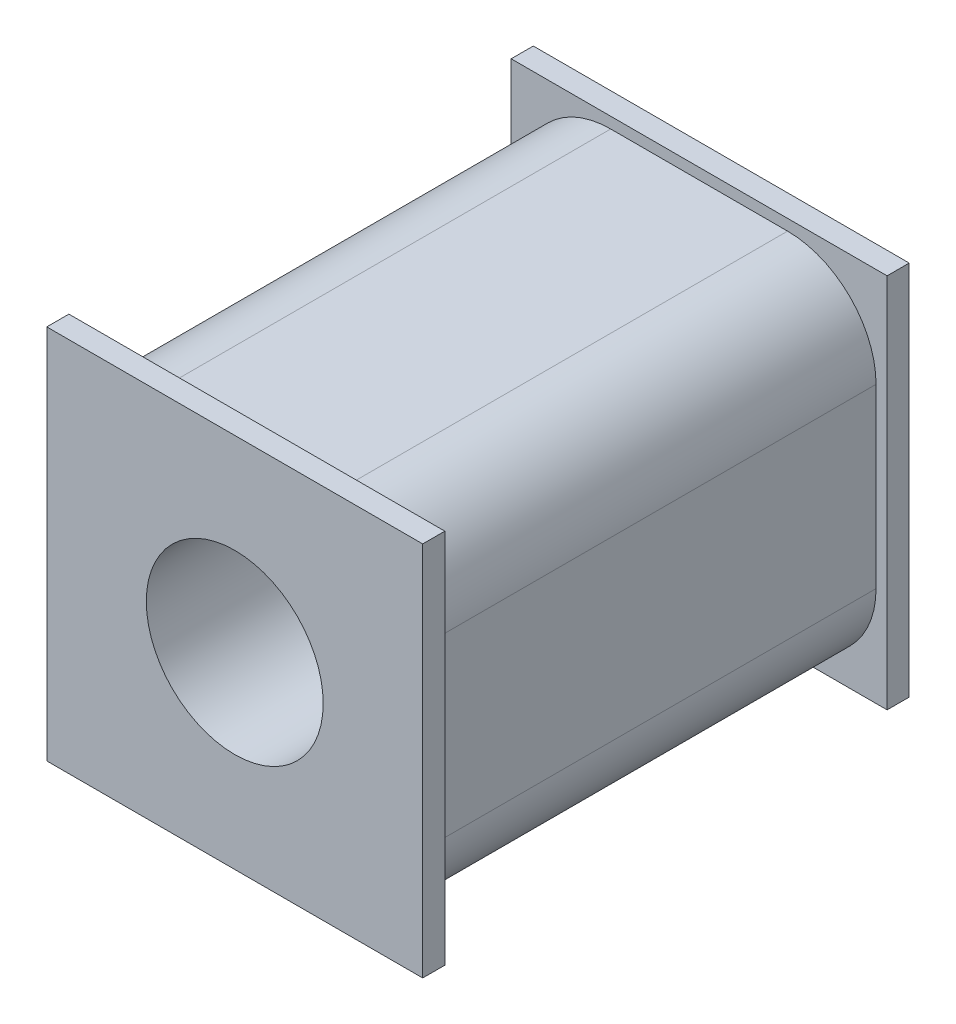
ISO-10303-21;
HEADER;
FILE_DESCRIPTION(('STEP AP214'),'2;1');
FILE_NAME('part.step','',(''),(''),'','','');
FILE_SCHEMA(('AUTOMOTIVE_DESIGN { 1 0 10303 214 1 1 1 1 }'));
ENDSEC;
DATA;
#1=APPLICATION_CONTEXT('core data for automotive mechanical design processes');
#2=APPLICATION_PROTOCOL_DEFINITION('international standard','automotive_design',2000,#1);
#3=PRODUCT_CONTEXT('',#1,'mechanical');
#4=PRODUCT('Part','Part','',(#3));
#5=PRODUCT_RELATED_PRODUCT_CATEGORY('part','',(#4));
#6=PRODUCT_DEFINITION_FORMATION('','',#4);
#7=PRODUCT_DEFINITION_CONTEXT('part definition',#1,'design');
#8=PRODUCT_DEFINITION('design','',#6,#7);
#9=PRODUCT_DEFINITION_SHAPE('','',#8);
#10=(LENGTH_UNIT() NAMED_UNIT(*) SI_UNIT(.MILLI.,.METRE.));
#11=(NAMED_UNIT(*) PLANE_ANGLE_UNIT() SI_UNIT($,.RADIAN.));
#12=(NAMED_UNIT(*) SI_UNIT($,.STERADIAN.) SOLID_ANGLE_UNIT());
#13=UNCERTAINTY_MEASURE_WITH_UNIT(LENGTH_MEASURE(1.E-05),#10,'distance_accuracy_value','');
#14=(GEOMETRIC_REPRESENTATION_CONTEXT(3) GLOBAL_UNCERTAINTY_ASSIGNED_CONTEXT((#13)) GLOBAL_UNIT_ASSIGNED_CONTEXT((#10,
#11,#12)) REPRESENTATION_CONTEXT('',''));
#15=CARTESIAN_POINT('',(0.,0.,0.));
#16=DIRECTION('',(0.,0.,1.));
#17=DIRECTION('',(1.,0.,0.));
#18=AXIS2_PLACEMENT_3D('',#15,#16,#17);
#19=CARTESIAN_POINT('',(-4.,4.,10.));
#20=DIRECTION('',(1.,0.,0.));
#21=DIRECTION('',(0.,1.,0.));
#22=AXIS2_PLACEMENT_3D('',#19,#20,#21);
#23=PLANE('',#22);
#24=DIRECTION('',(0.,-1.,0.));
#25=VECTOR('',#24,1.);
#26=CARTESIAN_POINT('',(-4.,4.,10.));
#27=LINE('',#26,#25);
#28=CARTESIAN_POINT('',(-4.,2.,10.));
#29=VERTEX_POINT('',#28);
#30=CARTESIAN_POINT('',(-4.,-2.,10.));
#31=VERTEX_POINT('',#30);
#32=EDGE_CURVE('E223',#29,#31,#27,.T.);
#33=ORIENTED_EDGE('',*,*,#32,.F.);
#34=DIRECTION('',(0.,0.,-1.));
#35=VECTOR('',#34,1.);
#36=CARTESIAN_POINT('',(-4.,2.,10.));
#37=LINE('',#36,#35);
#38=CARTESIAN_POINT('',(-4.,2.,0.));
#39=VERTEX_POINT('',#38);
#40=EDGE_CURVE('E11',#29,#39,#37,.T.);
#41=ORIENTED_EDGE('',*,*,#40,.T.);
#42=DIRECTION('',(0.,-1.,0.));
#43=VECTOR('',#42,1.);
#44=CARTESIAN_POINT('',(-4.,4.,0.));
#45=LINE('',#44,#43);
#46=CARTESIAN_POINT('',(-4.,-2.,0.));
#47=VERTEX_POINT('',#46);
#48=EDGE_CURVE('E215',#39,#47,#45,.T.);
#49=ORIENTED_EDGE('',*,*,#48,.T.);
#50=DIRECTION('',(0.,0.,-1.));
#51=VECTOR('',#50,1.);
#52=CARTESIAN_POINT('',(-4.,-2.,10.));
#53=LINE('',#52,#51);
#54=EDGE_CURVE('E36',#47,#31,#53,.F.);
#55=ORIENTED_EDGE('',*,*,#54,.T.);
#56=EDGE_LOOP('',(#33,#41,#49,#55));
#57=FACE_BOUND('',#56,.T.);
#58=ADVANCED_FACE('F29',(#57),#23,.F.);
#59=CARTESIAN_POINT('',(-4.,-4.,10.));
#60=DIRECTION('',(0.,1.,0.));
#61=DIRECTION('',(-1.,0.,0.));
#62=AXIS2_PLACEMENT_3D('',#59,#60,#61);
#63=PLANE('',#62);
#64=DIRECTION('',(1.,0.,0.));
#65=VECTOR('',#64,1.);
#66=CARTESIAN_POINT('',(-4.,-4.,0.));
#67=LINE('',#66,#65);
#68=CARTESIAN_POINT('',(-2.,-4.,0.));
#69=VERTEX_POINT('',#68);
#70=CARTESIAN_POINT('',(2.,-4.,0.));
#71=VERTEX_POINT('',#70);
#72=EDGE_CURVE('E217',#69,#71,#67,.T.);
#73=ORIENTED_EDGE('',*,*,#72,.T.);
#74=DIRECTION('',(0.,0.,-1.));
#75=VECTOR('',#74,1.);
#76=CARTESIAN_POINT('',(2.,-4.,10.));
#77=LINE('',#76,#75);
#78=CARTESIAN_POINT('',(2.,-4.,10.));
#79=VERTEX_POINT('',#78);
#80=EDGE_CURVE('E43',#71,#79,#77,.F.);
#81=ORIENTED_EDGE('',*,*,#80,.T.);
#82=DIRECTION('',(1.,0.,0.));
#83=VECTOR('',#82,1.);
#84=CARTESIAN_POINT('',(-4.,-4.,10.));
#85=LINE('',#84,#83);
#86=CARTESIAN_POINT('',(-2.,-4.,10.));
#87=VERTEX_POINT('',#86);
#88=EDGE_CURVE('E226',#87,#79,#85,.T.);
#89=ORIENTED_EDGE('',*,*,#88,.F.);
#90=DIRECTION('',(0.,0.,-1.));
#91=VECTOR('',#90,1.);
#92=CARTESIAN_POINT('',(-2.,-4.,10.));
#93=LINE('',#92,#91);
#94=EDGE_CURVE('E269',#87,#69,#93,.T.);
#95=ORIENTED_EDGE('',*,*,#94,.T.);
#96=EDGE_LOOP('',(#73,#81,#89,#95));
#97=FACE_BOUND('',#96,.T.);
#98=ADVANCED_FACE('F273',(#97),#63,.F.);
#99=CARTESIAN_POINT('',(4.,4.,10.));
#100=DIRECTION('',(-1.,0.,0.));
#101=DIRECTION('',(0.,0.,1.));
#102=AXIS2_PLACEMENT_3D('',#99,#100,#101);
#103=PLANE('',#102);
#104=DIRECTION('',(0.,1.,0.));
#105=VECTOR('',#104,1.);
#106=CARTESIAN_POINT('',(4.,4.,0.));
#107=LINE('',#106,#105);
#108=CARTESIAN_POINT('',(4.,-2.,0.));
#109=VERTEX_POINT('',#108);
#110=CARTESIAN_POINT('',(4.,2.,0.));
#111=VERTEX_POINT('',#110);
#112=EDGE_CURVE('E219',#109,#111,#107,.T.);
#113=ORIENTED_EDGE('',*,*,#112,.T.);
#114=DIRECTION('',(0.,0.,-1.));
#115=VECTOR('',#114,1.);
#116=CARTESIAN_POINT('',(4.,2.,10.));
#117=LINE('',#116,#115);
#118=CARTESIAN_POINT('',(4.,2.,10.));
#119=VERTEX_POINT('',#118);
#120=EDGE_CURVE('E255',#111,#119,#117,.F.);
#121=ORIENTED_EDGE('',*,*,#120,.T.);
#122=DIRECTION('',(0.,1.,0.));
#123=VECTOR('',#122,1.);
#124=CARTESIAN_POINT('',(4.,4.,10.));
#125=LINE('',#124,#123);
#126=CARTESIAN_POINT('',(4.,-2.,10.));
#127=VERTEX_POINT('',#126);
#128=EDGE_CURVE('E229',#127,#119,#125,.T.);
#129=ORIENTED_EDGE('',*,*,#128,.F.);
#130=DIRECTION('',(0.,0.,-1.));
#131=VECTOR('',#130,1.);
#132=CARTESIAN_POINT('',(4.,-2.,10.));
#133=LINE('',#132,#131);
#134=EDGE_CURVE('E252',#127,#109,#133,.T.);
#135=ORIENTED_EDGE('',*,*,#134,.T.);
#136=EDGE_LOOP('',(#113,#121,#129,#135));
#137=FACE_BOUND('',#136,.T.);
#138=ADVANCED_FACE('F282',(#137),#103,.F.);
#139=CARTESIAN_POINT('',(-4.,4.,10.));
#140=DIRECTION('',(0.,-1.,0.));
#141=DIRECTION('',(0.,0.,-1.));
#142=AXIS2_PLACEMENT_3D('',#139,#140,#141);
#143=PLANE('',#142);
#144=DIRECTION('',(-1.,0.,0.));
#145=VECTOR('',#144,1.);
#146=CARTESIAN_POINT('',(-4.,4.,10.));
#147=LINE('',#146,#145);
#148=CARTESIAN_POINT('',(2.,4.,10.));
#149=VERTEX_POINT('',#148);
#150=CARTESIAN_POINT('',(-2.,4.,10.));
#151=VERTEX_POINT('',#150);
#152=EDGE_CURVE('E232',#149,#151,#147,.T.);
#153=ORIENTED_EDGE('',*,*,#152,.F.);
#154=DIRECTION('',(0.,0.,-1.));
#155=VECTOR('',#154,1.);
#156=CARTESIAN_POINT('',(2.,4.,10.));
#157=LINE('',#156,#155);
#158=CARTESIAN_POINT('',(2.,4.,0.));
#159=VERTEX_POINT('',#158);
#160=EDGE_CURVE('E237',#149,#159,#157,.T.);
#161=ORIENTED_EDGE('',*,*,#160,.T.);
#162=DIRECTION('',(-1.,0.,0.));
#163=VECTOR('',#162,1.);
#164=CARTESIAN_POINT('',(-4.,4.,0.));
#165=LINE('',#164,#163);
#166=CARTESIAN_POINT('',(-2.,4.,0.));
#167=VERTEX_POINT('',#166);
#168=EDGE_CURVE('E221',#159,#167,#165,.T.);
#169=ORIENTED_EDGE('',*,*,#168,.T.);
#170=DIRECTION('',(0.,0.,-1.));
#171=VECTOR('',#170,1.);
#172=CARTESIAN_POINT('',(-2.,4.,10.));
#173=LINE('',#172,#171);
#174=EDGE_CURVE('E235',#167,#151,#173,.F.);
#175=ORIENTED_EDGE('',*,*,#174,.T.);
#176=EDGE_LOOP('',(#153,#161,#169,#175));
#177=FACE_BOUND('',#176,.T.);
#178=ADVANCED_FACE('F296',(#177),#143,.F.);
#179=CARTESIAN_POINT('',(2.,2.,10.));
#180=DIRECTION('',(0.,0.,-1.));
#181=DIRECTION('',(-1.,0.,0.));
#182=AXIS2_PLACEMENT_3D('',#179,#180,#181);
#183=CYLINDRICAL_SURFACE('',#182,2.);
#184=CARTESIAN_POINT('',(2.,2.,10.));
#185=DIRECTION('',(0.,0.,1.));
#186=DIRECTION('',(1.,0.,0.));
#187=AXIS2_PLACEMENT_3D('',#184,#185,#186);
#188=CIRCLE('',#187,2.);
#189=EDGE_CURVE('E266',#119,#149,#188,.T.);
#190=ORIENTED_EDGE('',*,*,#189,.F.);
#191=ORIENTED_EDGE('',*,*,#120,.F.);
#192=CARTESIAN_POINT('',(2.,2.,0.));
#193=DIRECTION('',(0.,0.,1.));
#194=DIRECTION('',(1.,0.,0.));
#195=AXIS2_PLACEMENT_3D('',#192,#193,#194);
#196=CIRCLE('',#195,2.);
#197=EDGE_CURVE('E249',#159,#111,#196,.F.);
#198=ORIENTED_EDGE('',*,*,#197,.F.);
#199=ORIENTED_EDGE('',*,*,#160,.F.);
#200=EDGE_LOOP('',(#190,#191,#198,#199));
#201=FACE_BOUND('',#200,.T.);
#202=ADVANCED_FACE('F299',(#201),#183,.T.);
#203=CARTESIAN_POINT('',(2.,-2.,10.));
#204=DIRECTION('',(0.,0.,-1.));
#205=DIRECTION('',(-1.,0.,0.));
#206=AXIS2_PLACEMENT_3D('',#203,#204,#205);
#207=CYLINDRICAL_SURFACE('',#206,2.);
#208=CARTESIAN_POINT('',(2.,-2.,10.));
#209=DIRECTION('',(0.,0.,1.));
#210=DIRECTION('',(1.,0.,0.));
#211=AXIS2_PLACEMENT_3D('',#208,#209,#210);
#212=CIRCLE('',#211,2.);
#213=EDGE_CURVE('E263',#79,#127,#212,.T.);
#214=ORIENTED_EDGE('',*,*,#213,.F.);
#215=ORIENTED_EDGE('',*,*,#80,.F.);
#216=CARTESIAN_POINT('',(2.,-2.,0.));
#217=DIRECTION('',(0.,0.,1.));
#218=DIRECTION('',(1.,0.,0.));
#219=AXIS2_PLACEMENT_3D('',#216,#217,#218);
#220=CIRCLE('',#219,2.);
#221=EDGE_CURVE('E246',#109,#71,#220,.F.);
#222=ORIENTED_EDGE('',*,*,#221,.F.);
#223=ORIENTED_EDGE('',*,*,#134,.F.);
#224=EDGE_LOOP('',(#214,#215,#222,#223));
#225=FACE_BOUND('',#224,.T.);
#226=ADVANCED_FACE('F280',(#225),#207,.T.);
#227=CARTESIAN_POINT('',(-2.,2.,10.));
#228=DIRECTION('',(0.,0.,-1.));
#229=DIRECTION('',(-1.,0.,0.));
#230=AXIS2_PLACEMENT_3D('',#227,#228,#229);
#231=CYLINDRICAL_SURFACE('',#230,2.);
#232=CARTESIAN_POINT('',(-2.,2.,10.));
#233=DIRECTION('',(0.,0.,1.));
#234=DIRECTION('',(1.,0.,0.));
#235=AXIS2_PLACEMENT_3D('',#232,#233,#234);
#236=CIRCLE('',#235,2.);
#237=EDGE_CURVE('E260',#151,#29,#236,.T.);
#238=ORIENTED_EDGE('',*,*,#237,.F.);
#239=ORIENTED_EDGE('',*,*,#174,.F.);
#240=CARTESIAN_POINT('',(-2.,2.,0.));
#241=DIRECTION('',(0.,0.,1.));
#242=DIRECTION('',(1.,0.,0.));
#243=AXIS2_PLACEMENT_3D('',#240,#241,#242);
#244=CIRCLE('',#243,2.);
#245=EDGE_CURVE('E243',#39,#167,#244,.F.);
#246=ORIENTED_EDGE('',*,*,#245,.F.);
#247=ORIENTED_EDGE('',*,*,#40,.F.);
#248=EDGE_LOOP('',(#238,#239,#246,#247));
#249=FACE_BOUND('',#248,.T.);
#250=ADVANCED_FACE('F294',(#249),#231,.T.);
#251=CARTESIAN_POINT('',(-2.,-2.,10.));
#252=DIRECTION('',(0.,0.,-1.));
#253=DIRECTION('',(-1.,0.,0.));
#254=AXIS2_PLACEMENT_3D('',#251,#252,#253);
#255=CYLINDRICAL_SURFACE('',#254,2.);
#256=CARTESIAN_POINT('',(-2.,-2.,10.));
#257=DIRECTION('',(0.,0.,1.));
#258=DIRECTION('',(1.,0.,0.));
#259=AXIS2_PLACEMENT_3D('',#256,#257,#258);
#260=CIRCLE('',#259,2.);
#261=EDGE_CURVE('E257',#31,#87,#260,.T.);
#262=ORIENTED_EDGE('',*,*,#261,.F.);
#263=ORIENTED_EDGE('',*,*,#54,.F.);
#264=CARTESIAN_POINT('',(-2.,-2.,0.));
#265=DIRECTION('',(0.,0.,1.));
#266=DIRECTION('',(1.,0.,0.));
#267=AXIS2_PLACEMENT_3D('',#264,#265,#266);
#268=CIRCLE('',#267,2.);
#269=EDGE_CURVE('E240',#69,#47,#268,.F.);
#270=ORIENTED_EDGE('',*,*,#269,.F.);
#271=ORIENTED_EDGE('',*,*,#94,.F.);
#272=EDGE_LOOP('',(#262,#263,#270,#271));
#273=FACE_BOUND('',#272,.T.);
#274=ADVANCED_FACE('F288',(#273),#255,.T.);
#275=CARTESIAN_POINT('',(-4.25,-4.25,10.));
#276=DIRECTION('',(0.,0.,1.));
#277=DIRECTION('',(1.,0.,0.));
#278=AXIS2_PLACEMENT_3D('',#275,#276,#277);
#279=PLANE('',#278);
#280=ORIENTED_EDGE('',*,*,#189,.T.);
#281=ORIENTED_EDGE('',*,*,#152,.T.);
#282=ORIENTED_EDGE('',*,*,#237,.T.);
#283=ORIENTED_EDGE('',*,*,#32,.T.);
#284=ORIENTED_EDGE('',*,*,#261,.T.);
#285=ORIENTED_EDGE('',*,*,#88,.T.);
#286=ORIENTED_EDGE('',*,*,#213,.T.);
#287=ORIENTED_EDGE('',*,*,#128,.T.);
#288=EDGE_LOOP('',(#280,#281,#282,#283,#284,#285,#286,#287));
#289=FACE_BOUND('',#288,.T.);
#290=DIRECTION('',(0.,-1.,0.));
#291=VECTOR('',#290,1.);
#292=CARTESIAN_POINT('',(-4.25,4.25,10.));
#293=LINE('',#292,#291);
#294=CARTESIAN_POINT('',(-4.25,4.25,10.));
#295=VERTEX_POINT('',#294);
#296=CARTESIAN_POINT('',(-4.25,-4.25,10.));
#297=VERTEX_POINT('',#296);
#298=EDGE_CURVE('E152',#295,#297,#293,.T.);
#299=ORIENTED_EDGE('',*,*,#298,.F.);
#300=DIRECTION('',(-1.,0.,0.));
#301=VECTOR('',#300,1.);
#302=CARTESIAN_POINT('',(-4.25,4.25,10.));
#303=LINE('',#302,#301);
#304=CARTESIAN_POINT('',(4.25,4.25,10.));
#305=VERTEX_POINT('',#304);
#306=EDGE_CURVE('E192',#305,#295,#303,.T.);
#307=ORIENTED_EDGE('',*,*,#306,.F.);
#308=DIRECTION('',(0.,1.,0.));
#309=VECTOR('',#308,1.);
#310=CARTESIAN_POINT('',(4.25,4.25,10.));
#311=LINE('',#310,#309);
#312=CARTESIAN_POINT('',(4.25,-4.25,10.));
#313=VERTEX_POINT('',#312);
#314=EDGE_CURVE('E190',#313,#305,#311,.T.);
#315=ORIENTED_EDGE('',*,*,#314,.F.);
#316=DIRECTION('',(1.,0.,0.));
#317=VECTOR('',#316,1.);
#318=CARTESIAN_POINT('',(-4.25,-4.25,10.));
#319=LINE('',#318,#317);
#320=EDGE_CURVE('E188',#297,#313,#319,.T.);
#321=ORIENTED_EDGE('',*,*,#320,.F.);
#322=EDGE_LOOP('',(#299,#307,#315,#321));
#323=FACE_BOUND('',#322,.T.);
#324=ADVANCED_FACE('F286',(#289,#323),#279,.F.);
#325=CARTESIAN_POINT('',(-4.25,-4.25,10.5));
#326=DIRECTION('',(0.,0.,1.));
#327=DIRECTION('',(1.,0.,0.));
#328=AXIS2_PLACEMENT_3D('',#325,#326,#327);
#329=PLANE('',#328);
#330=CARTESIAN_POINT('',(0.,0.,10.5));
#331=DIRECTION('',(0.,0.,-1.));
#332=DIRECTION('',(-1.,0.,0.));
#333=AXIS2_PLACEMENT_3D('',#330,#331,#332);
#334=CIRCLE('',#333,2.);
#335=CARTESIAN_POINT('',(-2.,0.,10.5));
#336=VERTEX_POINT('',#335);
#337=EDGE_CURVE('E162',#336,#336,#334,.T.);
#338=ORIENTED_EDGE('',*,*,#337,.T.);
#339=EDGE_LOOP('',(#338));
#340=FACE_BOUND('',#339,.T.);
#341=DIRECTION('',(0.,-1.,0.));
#342=VECTOR('',#341,1.);
#343=CARTESIAN_POINT('',(-4.25,4.25,10.5));
#344=LINE('',#343,#342);
#345=CARTESIAN_POINT('',(-4.25,4.25,10.5));
#346=VERTEX_POINT('',#345);
#347=CARTESIAN_POINT('',(-4.25,-4.25,10.5));
#348=VERTEX_POINT('',#347);
#349=EDGE_CURVE('E194',#346,#348,#344,.T.);
#350=ORIENTED_EDGE('',*,*,#349,.T.);
#351=DIRECTION('',(1.,0.,0.));
#352=VECTOR('',#351,1.);
#353=CARTESIAN_POINT('',(-4.25,-4.25,10.5));
#354=LINE('',#353,#352);
#355=CARTESIAN_POINT('',(4.25,-4.25,10.5));
#356=VERTEX_POINT('',#355);
#357=EDGE_CURVE('E197',#348,#356,#354,.T.);
#358=ORIENTED_EDGE('',*,*,#357,.T.);
#359=DIRECTION('',(0.,1.,0.));
#360=VECTOR('',#359,1.);
#361=CARTESIAN_POINT('',(4.25,4.25,10.5));
#362=LINE('',#361,#360);
#363=CARTESIAN_POINT('',(4.25,4.25,10.5));
#364=VERTEX_POINT('',#363);
#365=EDGE_CURVE('E199',#356,#364,#362,.T.);
#366=ORIENTED_EDGE('',*,*,#365,.T.);
#367=DIRECTION('',(-1.,0.,0.));
#368=VECTOR('',#367,1.);
#369=CARTESIAN_POINT('',(-4.25,4.25,10.5));
#370=LINE('',#369,#368);
#371=EDGE_CURVE('E201',#364,#346,#370,.T.);
#372=ORIENTED_EDGE('',*,*,#371,.T.);
#373=EDGE_LOOP('',(#350,#358,#366,#372));
#374=FACE_BOUND('',#373,.T.);
#375=ADVANCED_FACE('F333',(#340,#374),#329,.T.);
#376=CARTESIAN_POINT('',(-4.25,4.25,10.5));
#377=DIRECTION('',(0.,-1.,0.));
#378=DIRECTION('',(0.,0.,-1.));
#379=AXIS2_PLACEMENT_3D('',#376,#377,#378);
#380=PLANE('',#379);
#381=ORIENTED_EDGE('',*,*,#306,.T.);
#382=DIRECTION('',(0.,0.,-1.));
#383=VECTOR('',#382,1.);
#384=CARTESIAN_POINT('',(-4.25,4.25,10.5));
#385=LINE('',#384,#383);
#386=EDGE_CURVE('E203',#346,#295,#385,.T.);
#387=ORIENTED_EDGE('',*,*,#386,.F.);
#388=ORIENTED_EDGE('',*,*,#371,.F.);
#389=DIRECTION('',(0.,0.,-1.));
#390=VECTOR('',#389,1.);
#391=CARTESIAN_POINT('',(4.25,4.25,10.5));
#392=LINE('',#391,#390);
#393=EDGE_CURVE('E206',#364,#305,#392,.T.);
#394=ORIENTED_EDGE('',*,*,#393,.T.);
#395=EDGE_LOOP('',(#381,#387,#388,#394));
#396=FACE_BOUND('',#395,.T.);
#397=ADVANCED_FACE('F336',(#396),#380,.F.);
#398=CARTESIAN_POINT('',(4.25,4.25,10.5));
#399=DIRECTION('',(-1.,0.,0.));
#400=DIRECTION('',(0.,-1.,0.));
#401=AXIS2_PLACEMENT_3D('',#398,#399,#400);
#402=PLANE('',#401);
#403=ORIENTED_EDGE('',*,*,#314,.T.);
#404=ORIENTED_EDGE('',*,*,#393,.F.);
#405=ORIENTED_EDGE('',*,*,#365,.F.);
#406=DIRECTION('',(0.,0.,-1.));
#407=VECTOR('',#406,1.);
#408=CARTESIAN_POINT('',(4.25,-4.25,10.5));
#409=LINE('',#408,#407);
#410=EDGE_CURVE('E209',#356,#313,#409,.T.);
#411=ORIENTED_EDGE('',*,*,#410,.T.);
#412=EDGE_LOOP('',(#403,#404,#405,#411));
#413=FACE_BOUND('',#412,.T.);
#414=ADVANCED_FACE('F352',(#413),#402,.F.);
#415=CARTESIAN_POINT('',(-4.25,-4.25,10.5));
#416=DIRECTION('',(0.,1.,0.));
#417=DIRECTION('',(0.,0.,1.));
#418=AXIS2_PLACEMENT_3D('',#415,#416,#417);
#419=PLANE('',#418);
#420=ORIENTED_EDGE('',*,*,#320,.T.);
#421=ORIENTED_EDGE('',*,*,#410,.F.);
#422=ORIENTED_EDGE('',*,*,#357,.F.);
#423=DIRECTION('',(0.,0.,-1.));
#424=VECTOR('',#423,1.);
#425=CARTESIAN_POINT('',(-4.25,-4.25,10.5));
#426=LINE('',#425,#424);
#427=EDGE_CURVE('E212',#348,#297,#426,.T.);
#428=ORIENTED_EDGE('',*,*,#427,.T.);
#429=EDGE_LOOP('',(#420,#421,#422,#428));
#430=FACE_BOUND('',#429,.T.);
#431=ADVANCED_FACE('F347',(#430),#419,.F.);
#432=CARTESIAN_POINT('',(-4.25,4.25,10.5));
#433=DIRECTION('',(1.,0.,0.));
#434=DIRECTION('',(0.,1.,0.));
#435=AXIS2_PLACEMENT_3D('',#432,#433,#434);
#436=PLANE('',#435);
#437=ORIENTED_EDGE('',*,*,#298,.T.);
#438=ORIENTED_EDGE('',*,*,#427,.F.);
#439=ORIENTED_EDGE('',*,*,#349,.F.);
#440=ORIENTED_EDGE('',*,*,#386,.T.);
#441=EDGE_LOOP('',(#437,#438,#439,#440));
#442=FACE_BOUND('',#441,.T.);
#443=ADVANCED_FACE('F344',(#442),#436,.F.);
#444=CARTESIAN_POINT('',(-4.25,-4.25,0.));
#445=DIRECTION('',(0.,0.,-1.));
#446=DIRECTION('',(1.,0.,0.));
#447=AXIS2_PLACEMENT_3D('',#444,#445,#446);
#448=PLANE('',#447);
#449=ORIENTED_EDGE('',*,*,#197,.T.);
#450=ORIENTED_EDGE('',*,*,#112,.F.);
#451=ORIENTED_EDGE('',*,*,#221,.T.);
#452=ORIENTED_EDGE('',*,*,#72,.F.);
#453=ORIENTED_EDGE('',*,*,#269,.T.);
#454=ORIENTED_EDGE('',*,*,#48,.F.);
#455=ORIENTED_EDGE('',*,*,#245,.T.);
#456=ORIENTED_EDGE('',*,*,#168,.F.);
#457=EDGE_LOOP('',(#449,#450,#451,#452,#453,#454,#455,#456));
#458=FACE_BOUND('',#457,.T.);
#459=DIRECTION('',(0.,-1.,0.));
#460=VECTOR('',#459,1.);
#461=CARTESIAN_POINT('',(-4.25,4.25,0.));
#462=LINE('',#461,#460);
#463=CARTESIAN_POINT('',(-4.25,4.25,0.));
#464=VERTEX_POINT('',#463);
#465=CARTESIAN_POINT('',(-4.25,-4.25,0.));
#466=VERTEX_POINT('',#465);
#467=EDGE_CURVE('E156',#464,#466,#462,.T.);
#468=ORIENTED_EDGE('',*,*,#467,.T.);
#469=DIRECTION('',(1.,0.,0.));
#470=VECTOR('',#469,1.);
#471=CARTESIAN_POINT('',(-4.25,-4.25,0.));
#472=LINE('',#471,#470);
#473=CARTESIAN_POINT('',(4.25,-4.25,0.));
#474=VERTEX_POINT('',#473);
#475=EDGE_CURVE('E168',#466,#474,#472,.T.);
#476=ORIENTED_EDGE('',*,*,#475,.T.);
#477=DIRECTION('',(0.,1.,0.));
#478=VECTOR('',#477,1.);
#479=CARTESIAN_POINT('',(4.25,4.25,0.));
#480=LINE('',#479,#478);
#481=CARTESIAN_POINT('',(4.25,4.25,0.));
#482=VERTEX_POINT('',#481);
#483=EDGE_CURVE('E166',#474,#482,#480,.T.);
#484=ORIENTED_EDGE('',*,*,#483,.T.);
#485=DIRECTION('',(-1.,0.,0.));
#486=VECTOR('',#485,1.);
#487=CARTESIAN_POINT('',(-4.25,4.25,0.));
#488=LINE('',#487,#486);
#489=EDGE_CURVE('E145',#482,#464,#488,.T.);
#490=ORIENTED_EDGE('',*,*,#489,.T.);
#491=EDGE_LOOP('',(#468,#476,#484,#490));
#492=FACE_BOUND('',#491,.T.);
#493=ADVANCED_FACE('F164',(#458,#492),#448,.F.);
#494=CARTESIAN_POINT('',(-4.25,-4.25,-0.5));
#495=DIRECTION('',(0.,0.,-1.));
#496=DIRECTION('',(1.,0.,0.));
#497=AXIS2_PLACEMENT_3D('',#494,#495,#496);
#498=PLANE('',#497);
#499=CARTESIAN_POINT('',(0.,0.,-0.5));
#500=DIRECTION('',(0.,0.,-1.));
#501=DIRECTION('',(-1.,0.,0.));
#502=AXIS2_PLACEMENT_3D('',#499,#500,#501);
#503=CIRCLE('',#502,2.);
#504=CARTESIAN_POINT('',(-2.,0.,-0.5));
#505=VERTEX_POINT('',#504);
#506=EDGE_CURVE('E329',#505,#505,#503,.T.);
#507=ORIENTED_EDGE('',*,*,#506,.F.);
#508=EDGE_LOOP('',(#507));
#509=FACE_BOUND('',#508,.T.);
#510=DIRECTION('',(0.,-1.,0.));
#511=VECTOR('',#510,1.);
#512=CARTESIAN_POINT('',(-4.25,4.25,-0.5));
#513=LINE('',#512,#511);
#514=CARTESIAN_POINT('',(-4.25,4.25,-0.5));
#515=VERTEX_POINT('',#514);
#516=CARTESIAN_POINT('',(-4.25,-4.25,-0.5));
#517=VERTEX_POINT('',#516);
#518=EDGE_CURVE('E173',#515,#517,#513,.T.);
#519=ORIENTED_EDGE('',*,*,#518,.F.);
#520=DIRECTION('',(-1.,0.,0.));
#521=VECTOR('',#520,1.);
#522=CARTESIAN_POINT('',(-4.25,4.25,-0.5));
#523=LINE('',#522,#521);
#524=CARTESIAN_POINT('',(4.25,4.25,-0.5));
#525=VERTEX_POINT('',#524);
#526=EDGE_CURVE('E148',#525,#515,#523,.T.);
#527=ORIENTED_EDGE('',*,*,#526,.F.);
#528=DIRECTION('',(0.,1.,0.));
#529=VECTOR('',#528,1.);
#530=CARTESIAN_POINT('',(4.25,4.25,-0.5));
#531=LINE('',#530,#529);
#532=CARTESIAN_POINT('',(4.25,-4.25,-0.5));
#533=VERTEX_POINT('',#532);
#534=EDGE_CURVE('E176',#533,#525,#531,.T.);
#535=ORIENTED_EDGE('',*,*,#534,.F.);
#536=DIRECTION('',(1.,0.,0.));
#537=VECTOR('',#536,1.);
#538=CARTESIAN_POINT('',(-4.25,-4.25,-0.5));
#539=LINE('',#538,#537);
#540=EDGE_CURVE('E179',#517,#533,#539,.T.);
#541=ORIENTED_EDGE('',*,*,#540,.F.);
#542=EDGE_LOOP('',(#519,#527,#535,#541));
#543=FACE_BOUND('',#542,.T.);
#544=ADVANCED_FACE('F423',(#509,#543),#498,.T.);
#545=CARTESIAN_POINT('',(-4.25,-4.25,-0.5));
#546=DIRECTION('',(0.,-1.,0.));
#547=DIRECTION('',(0.,0.,-1.));
#548=AXIS2_PLACEMENT_3D('',#545,#546,#547);
#549=PLANE('',#548);
#550=ORIENTED_EDGE('',*,*,#475,.F.);
#551=DIRECTION('',(0.,0.,1.));
#552=VECTOR('',#551,1.);
#553=CARTESIAN_POINT('',(-4.25,-4.25,-0.5));
#554=LINE('',#553,#552);
#555=EDGE_CURVE('E158',#517,#466,#554,.T.);
#556=ORIENTED_EDGE('',*,*,#555,.F.);
#557=ORIENTED_EDGE('',*,*,#540,.T.);
#558=DIRECTION('',(0.,0.,1.));
#559=VECTOR('',#558,1.);
#560=CARTESIAN_POINT('',(4.25,-4.25,-0.5));
#561=LINE('',#560,#559);
#562=EDGE_CURVE('E183',#533,#474,#561,.T.);
#563=ORIENTED_EDGE('',*,*,#562,.T.);
#564=EDGE_LOOP('',(#550,#556,#557,#563));
#565=FACE_BOUND('',#564,.T.);
#566=ADVANCED_FACE('F432',(#565),#549,.T.);
#567=CARTESIAN_POINT('',(4.25,4.25,-0.5));
#568=DIRECTION('',(1.,0.,0.));
#569=DIRECTION('',(0.,1.,0.));
#570=AXIS2_PLACEMENT_3D('',#567,#568,#569);
#571=PLANE('',#570);
#572=ORIENTED_EDGE('',*,*,#483,.F.);
#573=ORIENTED_EDGE('',*,*,#562,.F.);
#574=ORIENTED_EDGE('',*,*,#534,.T.);
#575=DIRECTION('',(0.,0.,1.));
#576=VECTOR('',#575,1.);
#577=CARTESIAN_POINT('',(4.25,4.25,-0.5));
#578=LINE('',#577,#576);
#579=EDGE_CURVE('E153',#525,#482,#578,.T.);
#580=ORIENTED_EDGE('',*,*,#579,.T.);
#581=EDGE_LOOP('',(#572,#573,#574,#580));
#582=FACE_BOUND('',#581,.T.);
#583=ADVANCED_FACE('F441',(#582),#571,.T.);
#584=CARTESIAN_POINT('',(-4.25,4.25,-0.5));
#585=DIRECTION('',(0.,1.,0.));
#586=DIRECTION('',(0.,0.,1.));
#587=AXIS2_PLACEMENT_3D('',#584,#585,#586);
#588=PLANE('',#587);
#589=ORIENTED_EDGE('',*,*,#489,.F.);
#590=ORIENTED_EDGE('',*,*,#579,.F.);
#591=ORIENTED_EDGE('',*,*,#526,.T.);
#592=DIRECTION('',(0.,0.,1.));
#593=VECTOR('',#592,1.);
#594=CARTESIAN_POINT('',(-4.25,4.25,-0.5));
#595=LINE('',#594,#593);
#596=EDGE_CURVE('E141',#515,#464,#595,.T.);
#597=ORIENTED_EDGE('',*,*,#596,.T.);
#598=EDGE_LOOP('',(#589,#590,#591,#597));
#599=FACE_BOUND('',#598,.T.);
#600=ADVANCED_FACE('F143',(#599),#588,.T.);
#601=CARTESIAN_POINT('',(-4.25,4.25,-0.5));
#602=DIRECTION('',(-1.,0.,0.));
#603=DIRECTION('',(0.,-1.,0.));
#604=AXIS2_PLACEMENT_3D('',#601,#602,#603);
#605=PLANE('',#604);
#606=ORIENTED_EDGE('',*,*,#467,.F.);
#607=ORIENTED_EDGE('',*,*,#596,.F.);
#608=ORIENTED_EDGE('',*,*,#518,.T.);
#609=ORIENTED_EDGE('',*,*,#555,.T.);
#610=EDGE_LOOP('',(#606,#607,#608,#609));
#611=FACE_BOUND('',#610,.T.);
#612=ADVANCED_FACE('F157',(#611),#605,.T.);
#613=CARTESIAN_POINT('',(0.,0.,10.));
#614=DIRECTION('',(0.,0.,-1.));
#615=DIRECTION('',(-1.,0.,0.));
#616=AXIS2_PLACEMENT_3D('',#613,#614,#615);
#617=CYLINDRICAL_SURFACE('',#616,2.);
#618=ORIENTED_EDGE('',*,*,#337,.F.);
#619=EDGE_LOOP('',(#618));
#620=FACE_BOUND('',#619,.T.);
#621=ORIENTED_EDGE('',*,*,#506,.T.);
#622=EDGE_LOOP('',(#621));
#623=FACE_BOUND('',#622,.T.);
#624=ADVANCED_FACE('F317',(#620,#623),#617,.F.);
#625=CLOSED_SHELL('',(#58,#98,#138,#178,#202,#226,#250,#274,#324,#375,#397,#414,#431,#443,#493,
#544,#566,#583,#600,#612,#624));
#626=MANIFOLD_SOLID_BREP('B2',#625);
#627=ADVANCED_BREP_SHAPE_REPRESENTATION('',(#18,#626),#14);
#628=SHAPE_DEFINITION_REPRESENTATION(#9,#627);
ENDSEC;
END-ISO-10303-21;
